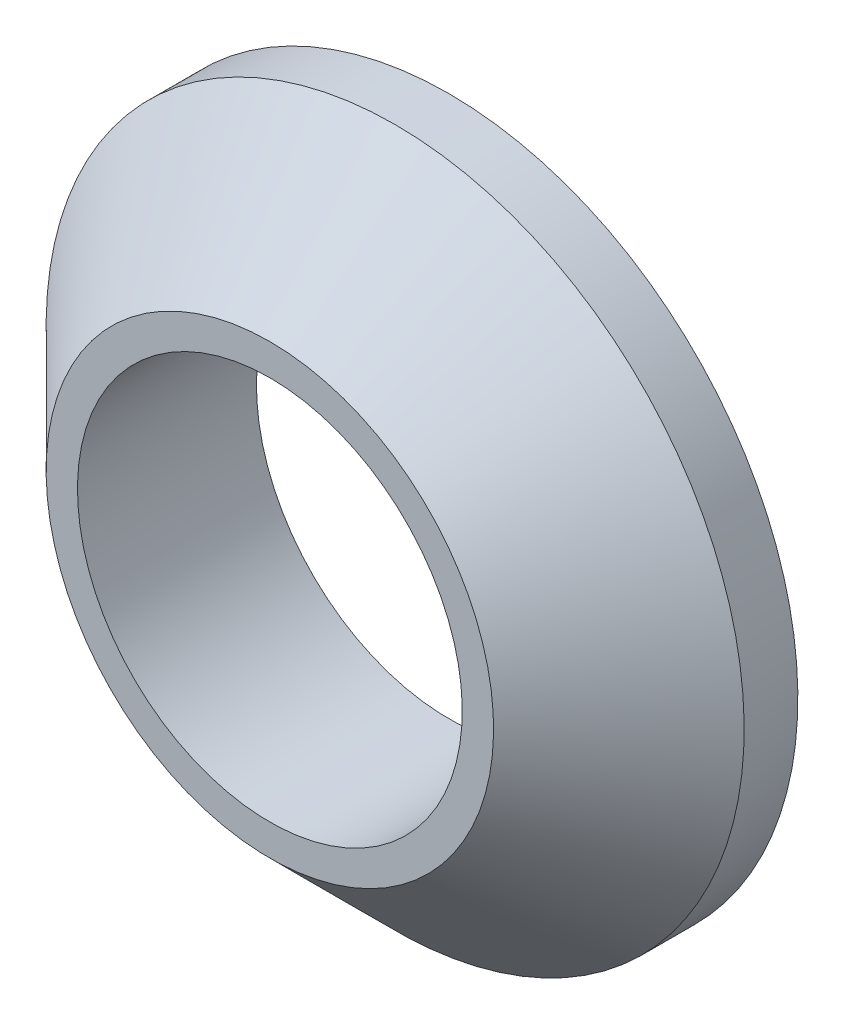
ISO-10303-21;
HEADER;
FILE_DESCRIPTION(('STEP AP214'),'2;1');
FILE_NAME('part.step','',(''),(''),'','','');
FILE_SCHEMA(('AUTOMOTIVE_DESIGN { 1 0 10303 214 1 1 1 1 }'));
ENDSEC;
DATA;
#1=APPLICATION_CONTEXT('core data for automotive mechanical design processes');
#2=APPLICATION_PROTOCOL_DEFINITION('international standard','automotive_design',2000,#1);
#3=PRODUCT_CONTEXT('',#1,'mechanical');
#4=PRODUCT('Part','Part','',(#3));
#5=PRODUCT_RELATED_PRODUCT_CATEGORY('part','',(#4));
#6=PRODUCT_DEFINITION_FORMATION('','',#4);
#7=PRODUCT_DEFINITION_CONTEXT('part definition',#1,'design');
#8=PRODUCT_DEFINITION('design','',#6,#7);
#9=PRODUCT_DEFINITION_SHAPE('','',#8);
#10=(LENGTH_UNIT() NAMED_UNIT(*) SI_UNIT(.MILLI.,.METRE.));
#11=(NAMED_UNIT(*) PLANE_ANGLE_UNIT() SI_UNIT($,.RADIAN.));
#12=(NAMED_UNIT(*) SI_UNIT($,.STERADIAN.) SOLID_ANGLE_UNIT());
#13=UNCERTAINTY_MEASURE_WITH_UNIT(LENGTH_MEASURE(1.E-05),#10,'distance_accuracy_value','');
#14=(GEOMETRIC_REPRESENTATION_CONTEXT(3) GLOBAL_UNCERTAINTY_ASSIGNED_CONTEXT((#13)) GLOBAL_UNIT_ASSIGNED_CONTEXT((#10,
#11,#12)) REPRESENTATION_CONTEXT('',''));
#15=CARTESIAN_POINT('',(0.,0.,0.));
#16=DIRECTION('',(0.,0.,1.));
#17=DIRECTION('',(1.,0.,0.));
#18=AXIS2_PLACEMENT_3D('',#15,#16,#17);
#19=CARTESIAN_POINT('',(3.9,0.,0.));
#20=DIRECTION('',(0.,0.,-1.));
#21=DIRECTION('',(0.,1.,0.));
#22=AXIS2_PLACEMENT_3D('',#19,#20,#21);
#23=PLANE('',#22);
#24=CARTESIAN_POINT('',(0.,0.,0.));
#25=DIRECTION('',(0.,0.,-1.));
#26=DIRECTION('',(0.,1.,0.));
#27=AXIS2_PLACEMENT_3D('',#24,#25,#26);
#28=CIRCLE('',#27,3.9);
#29=CARTESIAN_POINT('',(0.,3.9,0.));
#30=VERTEX_POINT('',#29);
#31=EDGE_CURVE('E31',#30,#30,#28,.T.);
#32=ORIENTED_EDGE('',*,*,#31,.T.);
#33=EDGE_LOOP('',(#32));
#34=FACE_BOUND('',#33,.T.);
#35=CARTESIAN_POINT('',(0.,0.,0.));
#36=DIRECTION('',(0.,0.,-1.));
#37=DIRECTION('',(0.,1.,0.));
#38=AXIS2_PLACEMENT_3D('',#35,#36,#37);
#39=CIRCLE('',#38,2.15);
#40=CARTESIAN_POINT('',(0.,2.15,0.));
#41=VERTEX_POINT('',#40);
#42=EDGE_CURVE('E8',#41,#41,#39,.T.);
#43=ORIENTED_EDGE('',*,*,#42,.F.);
#44=EDGE_LOOP('',(#43));
#45=FACE_BOUND('',#44,.T.);
#46=ADVANCED_FACE('F12',(#34,#45),#23,.T.);
#47=CARTESIAN_POINT('',(0.,0.,0.));
#48=DIRECTION('',(0.,0.,-1.));
#49=DIRECTION('',(0.,1.,0.));
#50=AXIS2_PLACEMENT_3D('',#47,#48,#49);
#51=CYLINDRICAL_SURFACE('',#50,2.15);
#52=ORIENTED_EDGE('',*,*,#42,.T.);
#53=EDGE_LOOP('',(#52));
#54=FACE_BOUND('',#53,.T.);
#55=CARTESIAN_POINT('',(0.,0.,2.));
#56=DIRECTION('',(0.,0.,-1.));
#57=DIRECTION('',(0.,1.,0.));
#58=AXIS2_PLACEMENT_3D('',#55,#56,#57);
#59=CIRCLE('',#58,2.15);
#60=CARTESIAN_POINT('',(0.,2.15,2.));
#61=VERTEX_POINT('',#60);
#62=EDGE_CURVE('E18',#61,#61,#59,.T.);
#63=ORIENTED_EDGE('',*,*,#62,.F.);
#64=EDGE_LOOP('',(#63));
#65=FACE_BOUND('',#64,.T.);
#66=ADVANCED_FACE('F51',(#54,#65),#51,.F.);
#67=CARTESIAN_POINT('',(2.15,0.,2.));
#68=DIRECTION('',(0.,0.,1.));
#69=DIRECTION('',(0.,-1.,0.));
#70=AXIS2_PLACEMENT_3D('',#67,#68,#69);
#71=PLANE('',#70);
#72=ORIENTED_EDGE('',*,*,#62,.T.);
#73=EDGE_LOOP('',(#72));
#74=FACE_BOUND('',#73,.T.);
#75=CARTESIAN_POINT('',(0.,0.,2.));
#76=DIRECTION('',(0.,0.,-1.));
#77=DIRECTION('',(0.,1.,0.));
#78=AXIS2_PLACEMENT_3D('',#75,#76,#77);
#79=CIRCLE('',#78,2.5);
#80=CARTESIAN_POINT('',(0.,2.5,2.));
#81=VERTEX_POINT('',#80);
#82=EDGE_CURVE('E22',#81,#81,#79,.T.);
#83=ORIENTED_EDGE('',*,*,#82,.F.);
#84=EDGE_LOOP('',(#83));
#85=FACE_BOUND('',#84,.T.);
#86=ADVANCED_FACE('F47',(#74,#85),#71,.T.);
#87=CARTESIAN_POINT('',(0.,0.,0.6));
#88=DIRECTION('',(0.,0.,-1.));
#89=DIRECTION('',(0.,1.,0.));
#90=AXIS2_PLACEMENT_3D('',#87,#88,#89);
#91=CONICAL_SURFACE('',#90,3.9,0.785398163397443);
#92=ORIENTED_EDGE('',*,*,#82,.T.);
#93=EDGE_LOOP('',(#92));
#94=FACE_BOUND('',#93,.T.);
#95=CARTESIAN_POINT('',(0.,0.,0.6));
#96=DIRECTION('',(0.,0.,-1.));
#97=DIRECTION('',(0.,1.,0.));
#98=AXIS2_PLACEMENT_3D('',#95,#96,#97);
#99=CIRCLE('',#98,3.9);
#100=CARTESIAN_POINT('',(0.,3.9,0.6));
#101=VERTEX_POINT('',#100);
#102=EDGE_CURVE('E26',#101,#101,#99,.T.);
#103=ORIENTED_EDGE('',*,*,#102,.F.);
#104=EDGE_LOOP('',(#103));
#105=FACE_BOUND('',#104,.T.);
#106=ADVANCED_FACE('F39',(#94,#105),#91,.T.);
#107=CARTESIAN_POINT('',(0.,0.,0.));
#108=DIRECTION('',(0.,0.,-1.));
#109=DIRECTION('',(0.,1.,0.));
#110=AXIS2_PLACEMENT_3D('',#107,#108,#109);
#111=CYLINDRICAL_SURFACE('',#110,3.9);
#112=ORIENTED_EDGE('',*,*,#102,.T.);
#113=EDGE_LOOP('',(#112));
#114=FACE_BOUND('',#113,.T.);
#115=ORIENTED_EDGE('',*,*,#31,.F.);
#116=EDGE_LOOP('',(#115));
#117=FACE_BOUND('',#116,.T.);
#118=ADVANCED_FACE('F37',(#114,#117),#111,.T.);
#119=CLOSED_SHELL('',(#46,#66,#86,#106,#118));
#120=MANIFOLD_SOLID_BREP('B1',#119);
#121=ADVANCED_BREP_SHAPE_REPRESENTATION('',(#18,#120),#14);
#122=SHAPE_DEFINITION_REPRESENTATION(#9,#121);
ENDSEC;
END-ISO-10303-21;
